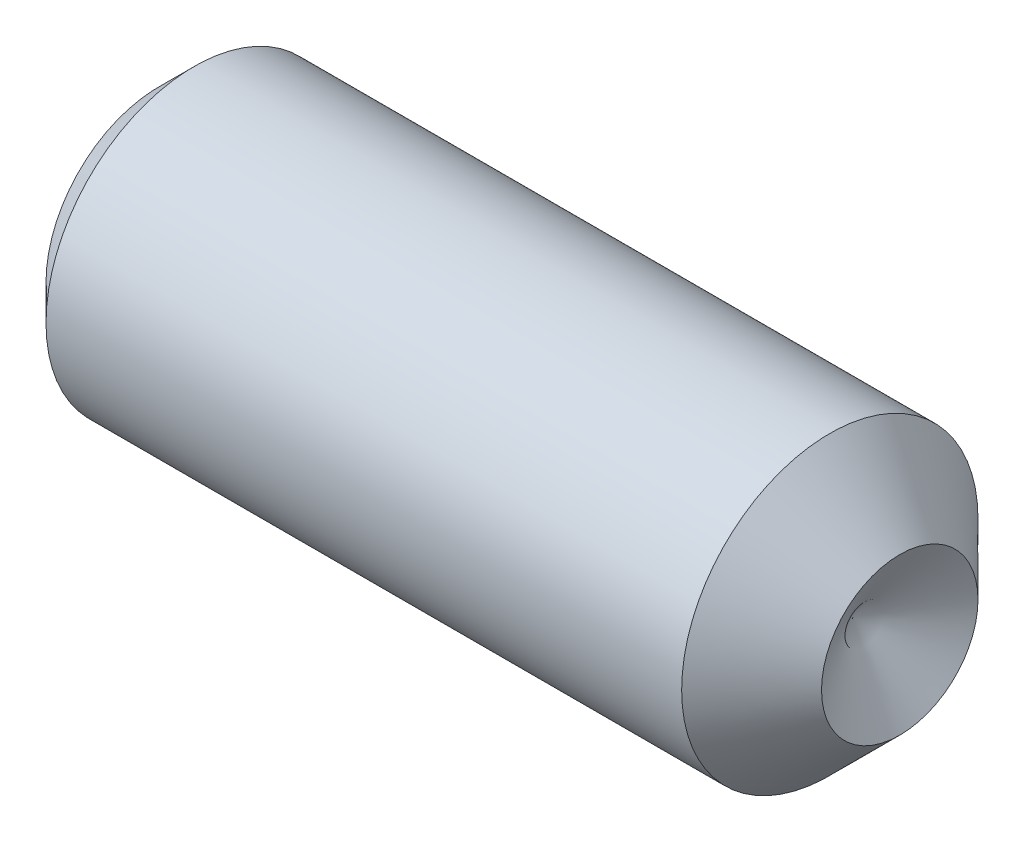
ISO-10303-21;
HEADER;
FILE_DESCRIPTION(('STEP AP214'),'2;1');
FILE_NAME('part.step','',(''),(''),'','','');
FILE_SCHEMA(('AUTOMOTIVE_DESIGN { 1 0 10303 214 1 1 1 1 }'));
ENDSEC;
DATA;
#1=APPLICATION_CONTEXT('core data for automotive mechanical design processes');
#2=APPLICATION_PROTOCOL_DEFINITION('international standard','automotive_design',2000,#1);
#3=PRODUCT_CONTEXT('',#1,'mechanical');
#4=PRODUCT('Part','Part','',(#3));
#5=PRODUCT_RELATED_PRODUCT_CATEGORY('part','',(#4));
#6=PRODUCT_DEFINITION_FORMATION('','',#4);
#7=PRODUCT_DEFINITION_CONTEXT('part definition',#1,'design');
#8=PRODUCT_DEFINITION('design','',#6,#7);
#9=PRODUCT_DEFINITION_SHAPE('','',#8);
#10=(LENGTH_UNIT() NAMED_UNIT(*) SI_UNIT(.MILLI.,.METRE.));
#11=(NAMED_UNIT(*) PLANE_ANGLE_UNIT() SI_UNIT($,.RADIAN.));
#12=(NAMED_UNIT(*) SI_UNIT($,.STERADIAN.) SOLID_ANGLE_UNIT());
#13=UNCERTAINTY_MEASURE_WITH_UNIT(LENGTH_MEASURE(1.E-05),#10,'distance_accuracy_value','');
#14=(GEOMETRIC_REPRESENTATION_CONTEXT(3) GLOBAL_UNCERTAINTY_ASSIGNED_CONTEXT((#13)) GLOBAL_UNIT_ASSIGNED_CONTEXT((#10,
#11,#12)) REPRESENTATION_CONTEXT('',''));
#15=CARTESIAN_POINT('',(0.,0.,0.));
#16=DIRECTION('',(0.,0.,1.));
#17=DIRECTION('',(1.,0.,0.));
#18=AXIS2_PLACEMENT_3D('',#15,#16,#17);
#19=CARTESIAN_POINT('',(3.175,3.175,0.));
#20=DIRECTION('',(1.,0.,0.));
#21=DIRECTION('',(0.,0.,-1.));
#22=AXIS2_PLACEMENT_3D('',#19,#20,#21);
#23=PLANE('',#22);
#24=DIRECTION('',(0.,0.,1.));
#25=VECTOR('',#24,1.);
#26=CARTESIAN_POINT('',(3.175,1.5875,0.916543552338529));
#27=LINE('',#26,#25);
#28=CARTESIAN_POINT('',(3.175,1.5875,0.916543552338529));
#29=VERTEX_POINT('',#28);
#30=CARTESIAN_POINT('',(3.175,1.5875,-0.916543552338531));
#31=VERTEX_POINT('',#30);
#32=EDGE_CURVE('E84',#29,#31,#27,.F.);
#33=ORIENTED_EDGE('',*,*,#32,.T.);
#34=DIRECTION('',(0.,0.866025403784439,0.5));
#35=VECTOR('',#34,1.);
#36=CARTESIAN_POINT('',(3.175,1.5875,-0.916543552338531));
#37=LINE('',#36,#35);
#38=CARTESIAN_POINT('',(3.175,0.,-1.83308710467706));
#39=VERTEX_POINT('',#38);
#40=EDGE_CURVE('E116',#31,#39,#37,.F.);
#41=ORIENTED_EDGE('',*,*,#40,.T.);
#42=DIRECTION('',(0.,-0.866025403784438,0.500000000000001));
#43=VECTOR('',#42,1.);
#44=CARTESIAN_POINT('',(3.175,-1.58749999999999,-0.916543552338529));
#45=LINE('',#44,#43);
#46=CARTESIAN_POINT('',(3.175,-1.58749999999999,-0.916543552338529));
#47=VERTEX_POINT('',#46);
#48=EDGE_CURVE('E113',#47,#39,#45,.F.);
#49=ORIENTED_EDGE('',*,*,#48,.F.);
#50=DIRECTION('',(0.,0.,1.));
#51=VECTOR('',#50,1.);
#52=CARTESIAN_POINT('',(3.175,-1.58749999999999,0.91654355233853));
#53=LINE('',#52,#51);
#54=CARTESIAN_POINT('',(3.175,-1.58749999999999,0.91654355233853));
#55=VERTEX_POINT('',#54);
#56=EDGE_CURVE('E108',#55,#47,#53,.F.);
#57=ORIENTED_EDGE('',*,*,#56,.F.);
#58=DIRECTION('',(0.,-0.866025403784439,-0.5));
#59=VECTOR('',#58,1.);
#60=CARTESIAN_POINT('',(3.175,-1.58749999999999,0.91654355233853));
#61=LINE('',#60,#59);
#62=CARTESIAN_POINT('',(3.175,0.,1.83308710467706));
#63=VERTEX_POINT('',#62);
#64=EDGE_CURVE('E79',#55,#63,#61,.F.);
#65=ORIENTED_EDGE('',*,*,#64,.T.);
#66=DIRECTION('',(0.,0.866025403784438,-0.500000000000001));
#67=VECTOR('',#66,1.);
#68=CARTESIAN_POINT('',(3.175,1.5875,0.916543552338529));
#69=LINE('',#68,#67);
#70=EDGE_CURVE('E92',#29,#63,#69,.F.);
#71=ORIENTED_EDGE('',*,*,#70,.F.);
#72=EDGE_LOOP('',(#33,#41,#49,#57,#65,#71));
#73=FACE_BOUND('',#72,.T.);
#74=ADVANCED_FACE('F25',(#73),#23,.F.);
#75=CARTESIAN_POINT('',(3.175,1.5875,0.916543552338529));
#76=DIRECTION('',(0.,1.,0.));
#77=DIRECTION('',(0.,0.,1.));
#78=AXIS2_PLACEMENT_3D('',#75,#76,#77);
#79=PLANE('',#78);
#80=DIRECTION('',(1.,0.,0.));
#81=VECTOR('',#80,1.);
#82=CARTESIAN_POINT('',(3.175,1.5875,-0.916543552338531));
#83=LINE('',#82,#81);
#84=CARTESIAN_POINT('',(0.,1.5875,-0.916543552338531));
#85=VERTEX_POINT('',#84);
#86=EDGE_CURVE('E90',#85,#31,#83,.T.);
#87=ORIENTED_EDGE('',*,*,#86,.T.);
#88=ORIENTED_EDGE('',*,*,#32,.F.);
#89=DIRECTION('',(1.,0.,0.));
#90=VECTOR('',#89,1.);
#91=CARTESIAN_POINT('',(3.175,1.5875,0.916543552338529));
#92=LINE('',#91,#90);
#93=CARTESIAN_POINT('',(0.,1.5875,0.916543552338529));
#94=VERTEX_POINT('',#93);
#95=EDGE_CURVE('E87',#94,#29,#92,.T.);
#96=ORIENTED_EDGE('',*,*,#95,.F.);
#97=DIRECTION('',(0.,0.,1.));
#98=VECTOR('',#97,1.);
#99=CARTESIAN_POINT('',(0.,1.5875,0.));
#100=LINE('',#99,#98);
#101=EDGE_CURVE('E119',#85,#94,#100,.T.);
#102=ORIENTED_EDGE('',*,*,#101,.F.);
#103=EDGE_LOOP('',(#87,#88,#96,#102));
#104=FACE_BOUND('',#103,.T.);
#105=ADVANCED_FACE('F85',(#104),#79,.F.);
#106=CARTESIAN_POINT('',(3.175,1.5875,0.916543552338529));
#107=DIRECTION('',(0.,-0.500000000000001,-0.866025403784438));
#108=DIRECTION('',(0.,0.866025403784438,-0.500000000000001));
#109=AXIS2_PLACEMENT_3D('',#106,#107,#108);
#110=PLANE('',#109);
#111=ORIENTED_EDGE('',*,*,#70,.T.);
#112=DIRECTION('',(1.,0.,0.));
#113=VECTOR('',#112,1.);
#114=CARTESIAN_POINT('',(3.175,0.,1.83308710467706));
#115=LINE('',#114,#113);
#116=CARTESIAN_POINT('',(0.,0.,1.83308710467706));
#117=VERTEX_POINT('',#116);
#118=EDGE_CURVE('E103',#63,#117,#115,.F.);
#119=ORIENTED_EDGE('',*,*,#118,.T.);
#120=DIRECTION('',(0.,-0.866025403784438,0.500000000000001));
#121=VECTOR('',#120,1.);
#122=CARTESIAN_POINT('',(0.,1.5875,0.916543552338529));
#123=LINE('',#122,#121);
#124=EDGE_CURVE('E98',#94,#117,#123,.T.);
#125=ORIENTED_EDGE('',*,*,#124,.F.);
#126=ORIENTED_EDGE('',*,*,#95,.T.);
#127=EDGE_LOOP('',(#111,#119,#125,#126));
#128=FACE_BOUND('',#127,.T.);
#129=ADVANCED_FACE('F96',(#128),#110,.T.);
#130=CARTESIAN_POINT('',(3.175,-1.58749999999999,0.91654355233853));
#131=DIRECTION('',(0.,-0.5,0.866025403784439));
#132=DIRECTION('',(0.,-0.866025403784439,-0.5));
#133=AXIS2_PLACEMENT_3D('',#130,#131,#132);
#134=PLANE('',#133);
#135=ORIENTED_EDGE('',*,*,#118,.F.);
#136=ORIENTED_EDGE('',*,*,#64,.F.);
#137=DIRECTION('',(1.,0.,0.));
#138=VECTOR('',#137,1.);
#139=CARTESIAN_POINT('',(3.175,-1.58749999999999,0.91654355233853));
#140=LINE('',#139,#138);
#141=CARTESIAN_POINT('',(0.,-1.58749999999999,0.91654355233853));
#142=VERTEX_POINT('',#141);
#143=EDGE_CURVE('E105',#142,#55,#140,.T.);
#144=ORIENTED_EDGE('',*,*,#143,.F.);
#145=DIRECTION('',(0.,-0.866025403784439,-0.5));
#146=VECTOR('',#145,1.);
#147=CARTESIAN_POINT('',(0.,0.,1.83308710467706));
#148=LINE('',#147,#146);
#149=EDGE_CURVE('E122',#117,#142,#148,.T.);
#150=ORIENTED_EDGE('',*,*,#149,.F.);
#151=EDGE_LOOP('',(#135,#136,#144,#150));
#152=FACE_BOUND('',#151,.T.);
#153=ADVANCED_FACE('F220',(#152),#134,.F.);
#154=CARTESIAN_POINT('',(3.175,-1.58749999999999,0.91654355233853));
#155=DIRECTION('',(0.,1.,0.));
#156=DIRECTION('',(0.,0.,1.));
#157=AXIS2_PLACEMENT_3D('',#154,#155,#156);
#158=PLANE('',#157);
#159=ORIENTED_EDGE('',*,*,#56,.T.);
#160=DIRECTION('',(1.,0.,0.));
#161=VECTOR('',#160,1.);
#162=CARTESIAN_POINT('',(3.175,-1.58749999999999,-0.916543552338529));
#163=LINE('',#162,#161);
#164=CARTESIAN_POINT('',(0.,-1.58749999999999,-0.916543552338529));
#165=VERTEX_POINT('',#164);
#166=EDGE_CURVE('E110',#165,#47,#163,.T.);
#167=ORIENTED_EDGE('',*,*,#166,.F.);
#168=DIRECTION('',(0.,0.,1.));
#169=VECTOR('',#168,1.);
#170=CARTESIAN_POINT('',(0.,-1.58749999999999,0.));
#171=LINE('',#170,#169);
#172=EDGE_CURVE('E125',#142,#165,#171,.F.);
#173=ORIENTED_EDGE('',*,*,#172,.F.);
#174=ORIENTED_EDGE('',*,*,#143,.T.);
#175=EDGE_LOOP('',(#159,#167,#173,#174));
#176=FACE_BOUND('',#175,.T.);
#177=ADVANCED_FACE('F211',(#176),#158,.T.);
#178=CARTESIAN_POINT('',(3.175,-1.58749999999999,-0.916543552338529));
#179=DIRECTION('',(0.,0.500000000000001,0.866025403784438));
#180=DIRECTION('',(0.,-0.866025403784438,0.500000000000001));
#181=AXIS2_PLACEMENT_3D('',#178,#179,#180);
#182=PLANE('',#181);
#183=ORIENTED_EDGE('',*,*,#48,.T.);
#184=DIRECTION('',(1.,0.,0.));
#185=VECTOR('',#184,1.);
#186=CARTESIAN_POINT('',(3.175,0.,-1.83308710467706));
#187=LINE('',#186,#185);
#188=CARTESIAN_POINT('',(0.,0.,-1.83308710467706));
#189=VERTEX_POINT('',#188);
#190=EDGE_CURVE('E43',#39,#189,#187,.F.);
#191=ORIENTED_EDGE('',*,*,#190,.T.);
#192=DIRECTION('',(0.,0.866025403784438,-0.500000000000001));
#193=VECTOR('',#192,1.);
#194=CARTESIAN_POINT('',(0.,-1.58749999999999,-0.916543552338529));
#195=LINE('',#194,#193);
#196=EDGE_CURVE('E128',#165,#189,#195,.T.);
#197=ORIENTED_EDGE('',*,*,#196,.F.);
#198=ORIENTED_EDGE('',*,*,#166,.T.);
#199=EDGE_LOOP('',(#183,#191,#197,#198));
#200=FACE_BOUND('',#199,.T.);
#201=ADVANCED_FACE('F201',(#200),#182,.T.);
#202=CARTESIAN_POINT('',(3.175,1.5875,-0.916543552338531));
#203=DIRECTION('',(0.,0.5,-0.866025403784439));
#204=DIRECTION('',(0.,0.866025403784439,0.5));
#205=AXIS2_PLACEMENT_3D('',#202,#203,#204);
#206=PLANE('',#205);
#207=ORIENTED_EDGE('',*,*,#190,.F.);
#208=ORIENTED_EDGE('',*,*,#40,.F.);
#209=ORIENTED_EDGE('',*,*,#86,.F.);
#210=DIRECTION('',(0.,0.866025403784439,0.5));
#211=VECTOR('',#210,1.);
#212=CARTESIAN_POINT('',(0.,0.,-1.83308710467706));
#213=LINE('',#212,#211);
#214=EDGE_CURVE('E131',#189,#85,#213,.T.);
#215=ORIENTED_EDGE('',*,*,#214,.F.);
#216=EDGE_LOOP('',(#207,#208,#209,#215));
#217=FACE_BOUND('',#216,.T.);
#218=ADVANCED_FACE('F158',(#217),#206,.F.);
#219=CARTESIAN_POINT('',(15.8750000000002,0.,0.));
#220=DIRECTION('',(1.,0.,0.));
#221=DIRECTION('',(0.,0.,-1.));
#222=AXIS2_PLACEMENT_3D('',#219,#220,#221);
#223=CONICAL_SURFACE('',#222,1.67640000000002,1.0297442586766);
#224=CARTESIAN_POINT('',(14.8677172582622,0.,0.));
#225=VERTEX_POINT('',#224);
#226=VERTEX_LOOP('',#225);
#227=FACE_BOUND('',#226,.T.);
#228=CARTESIAN_POINT('',(15.8750000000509,0.,0.));
#229=DIRECTION('',(-1.,0.,0.));
#230=DIRECTION('',(0.,0.,1.));
#231=AXIS2_PLACEMENT_3D('',#228,#229,#230);
#232=CIRCLE('',#231,1.67640000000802);
#233=CARTESIAN_POINT('',(15.8750000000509,0.,1.67640000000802));
#234=VERTEX_POINT('',#233);
#235=EDGE_CURVE('E134',#234,#234,#232,.T.);
#236=ORIENTED_EDGE('',*,*,#235,.F.);
#237=EDGE_LOOP('',(#236));
#238=FACE_BOUND('',#237,.T.);
#239=ADVANCED_FACE('F148',(#227,#238),#223,.F.);
#240=CARTESIAN_POINT('',(0.,0.,0.));
#241=DIRECTION('',(-1.,0.,0.));
#242=DIRECTION('',(0.,0.,1.));
#243=AXIS2_PLACEMENT_3D('',#240,#241,#242);
#244=PLANE('',#243);
#245=ORIENTED_EDGE('',*,*,#196,.T.);
#246=ORIENTED_EDGE('',*,*,#214,.T.);
#247=ORIENTED_EDGE('',*,*,#101,.T.);
#248=ORIENTED_EDGE('',*,*,#124,.T.);
#249=ORIENTED_EDGE('',*,*,#149,.T.);
#250=ORIENTED_EDGE('',*,*,#172,.T.);
#251=EDGE_LOOP('',(#245,#246,#247,#248,#249,#250));
#252=FACE_BOUND('',#251,.T.);
#253=CARTESIAN_POINT('',(-5.6843418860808E-11,0.,0.));
#254=DIRECTION('',(1.,0.,0.));
#255=DIRECTION('',(0.,0.,-1.));
#256=AXIS2_PLACEMENT_3D('',#253,#254,#255);
#257=CIRCLE('',#256,2.41935000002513);
#258=CARTESIAN_POINT('',(-5.6843418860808E-11,0.,-2.41935000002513));
#259=VERTEX_POINT('',#258);
#260=EDGE_CURVE('E28',#259,#259,#257,.T.);
#261=ORIENTED_EDGE('',*,*,#260,.F.);
#262=EDGE_LOOP('',(#261));
#263=FACE_BOUND('',#262,.T.);
#264=ADVANCED_FACE('F145',(#252,#263),#244,.T.);
#265=CARTESIAN_POINT('',(14.376400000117,0.,0.));
#266=DIRECTION('',(-1.,0.,0.));
#267=DIRECTION('',(0.,0.,1.));
#268=AXIS2_PLACEMENT_3D('',#265,#266,#267);
#269=CONICAL_SURFACE('',#268,3.17499999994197,0.785398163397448);
#270=CARTESIAN_POINT('',(14.3764,0.,0.));
#271=DIRECTION('',(-1.,0.,0.));
#272=DIRECTION('',(0.,0.,1.));
#273=AXIS2_PLACEMENT_3D('',#270,#271,#272);
#274=CIRCLE('',#273,3.175);
#275=CARTESIAN_POINT('',(14.3764,0.,3.175));
#276=VERTEX_POINT('',#275);
#277=EDGE_CURVE('E34',#276,#276,#274,.T.);
#278=ORIENTED_EDGE('',*,*,#277,.F.);
#279=EDGE_LOOP('',(#278));
#280=FACE_BOUND('',#279,.T.);
#281=ORIENTED_EDGE('',*,*,#235,.T.);
#282=EDGE_LOOP('',(#281));
#283=FACE_BOUND('',#282,.T.);
#284=ADVANCED_FACE('F147',(#280,#283),#269,.T.);
#285=CARTESIAN_POINT('',(0.755649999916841,0.,0.));
#286=DIRECTION('',(1.,0.,0.));
#287=DIRECTION('',(0.,0.,-1.));
#288=AXIS2_PLACEMENT_3D('',#285,#286,#287);
#289=CONICAL_SURFACE('',#288,3.17499999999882,0.785398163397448);
#290=CARTESIAN_POINT('',(0.755650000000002,0.,0.));
#291=DIRECTION('',(-1.,0.,0.));
#292=DIRECTION('',(0.,0.,1.));
#293=AXIS2_PLACEMENT_3D('',#290,#291,#292);
#294=CIRCLE('',#293,3.175);
#295=CARTESIAN_POINT('',(0.755650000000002,0.,3.175));
#296=VERTEX_POINT('',#295);
#297=EDGE_CURVE('E13',#296,#296,#294,.F.);
#298=ORIENTED_EDGE('',*,*,#297,.F.);
#299=EDGE_LOOP('',(#298));
#300=FACE_BOUND('',#299,.T.);
#301=ORIENTED_EDGE('',*,*,#260,.T.);
#302=EDGE_LOOP('',(#301));
#303=FACE_BOUND('',#302,.T.);
#304=ADVANCED_FACE('F143',(#300,#303),#289,.T.);
#305=CARTESIAN_POINT('',(-12.7,0.,0.));
#306=DIRECTION('',(-1.,0.,0.));
#307=DIRECTION('',(0.,0.,1.));
#308=AXIS2_PLACEMENT_3D('',#305,#306,#307);
#309=CYLINDRICAL_SURFACE('',#308,3.175);
#310=ORIENTED_EDGE('',*,*,#297,.T.);
#311=EDGE_LOOP('',(#310));
#312=FACE_BOUND('',#311,.T.);
#313=ORIENTED_EDGE('',*,*,#277,.T.);
#314=EDGE_LOOP('',(#313));
#315=FACE_BOUND('',#314,.T.);
#316=ADVANCED_FACE('F161',(#312,#315),#309,.T.);
#317=CLOSED_SHELL('',(#74,#105,#129,#153,#177,#201,#218,#239,#264,#284,#304,#316));
#318=MANIFOLD_SOLID_BREP('B1',#317);
#319=ADVANCED_BREP_SHAPE_REPRESENTATION('',(#18,#318),#14);
#320=SHAPE_DEFINITION_REPRESENTATION(#9,#319);
ENDSEC;
END-ISO-10303-21;
